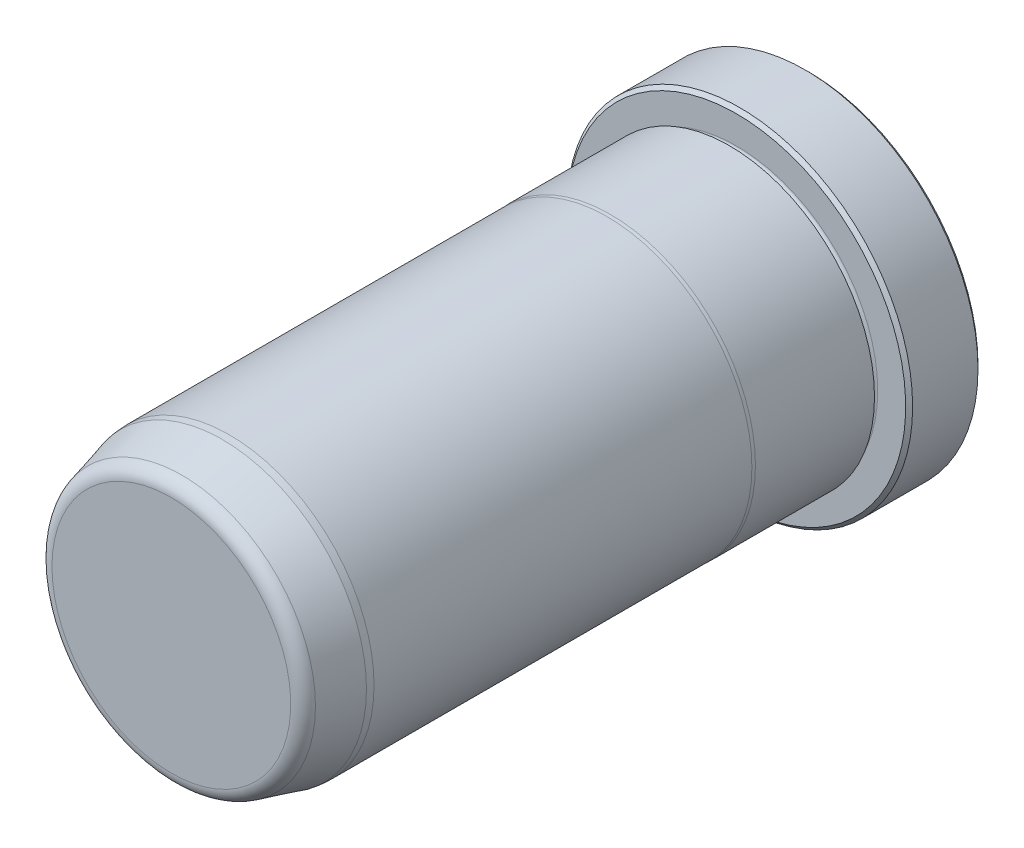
from build123d import *

# Parameters (mm, degrees)
FILLET6_R     = 1.5875
CHAMFER1_SIZE = 0.381


with BuildPart() as part:
    # Sketch1 → Revolve1 (revolve)
    with BuildSketch(Plane(origin=(0, 0, 0), x_dir=(0, 0, -1), z_dir=(1, 0, 0)), mode=Mode.PRIVATE) as revolve1_sk:
        with BuildLine():
            Line((0, 0), (0, 18.923))
            Line((0, 18.923), (-7.9248, 18.923))
            Line((-7.9248, 18.923), (-7.9248, 15.4813))
            ThreePointArc((-7.9248, 15.4813), (-8.3058, 15.1003), (-8.6868, 15.4813))
            Line((-8.6868, 15.4813), (-8.6868, 15.8877))
            Line((-8.6868, 15.8877), (-21.734763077, 15.8877))
            Line((-21.734763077, 15.8877), (-22.098, 15.8623))
            Line((-22.098, 15.8623), (-63.5, 15.8623))
            Line((-63.5, 15.8623), (-64.262, 15.795633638))
            Line((-64.262, 15.795633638), (-69.85, 14.298333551))
            Line((-69.85, 14.298333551), (-69.85, 0))
            Line((-69.85, 0), (0, 0))
        make_face()
    revolve(revolve1_sk.sketch.rotate(Axis((0, 0, 0), (0, 0, -1)), 90), axis=Axis((0, 0, 0), (0, 0, -1)))

    # Fillet6
    fillet6_edges = [part.edges().sort_by_distance(p)[0] for p in [
        (-14.298333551, 0, 69.85),
    ]]
    fillet(fillet6_edges, radius=FILLET6_R)

    # Chamfer1
    chamfer1_edges = [part.edges().sort_by_distance(p)[0] for p in [
        (-18.923, 0, 7.9248),
        (-18.923, 0, 0),
    ]]
    chamfer(chamfer1_edges, length=CHAMFER1_SIZE)


solid = part.part
